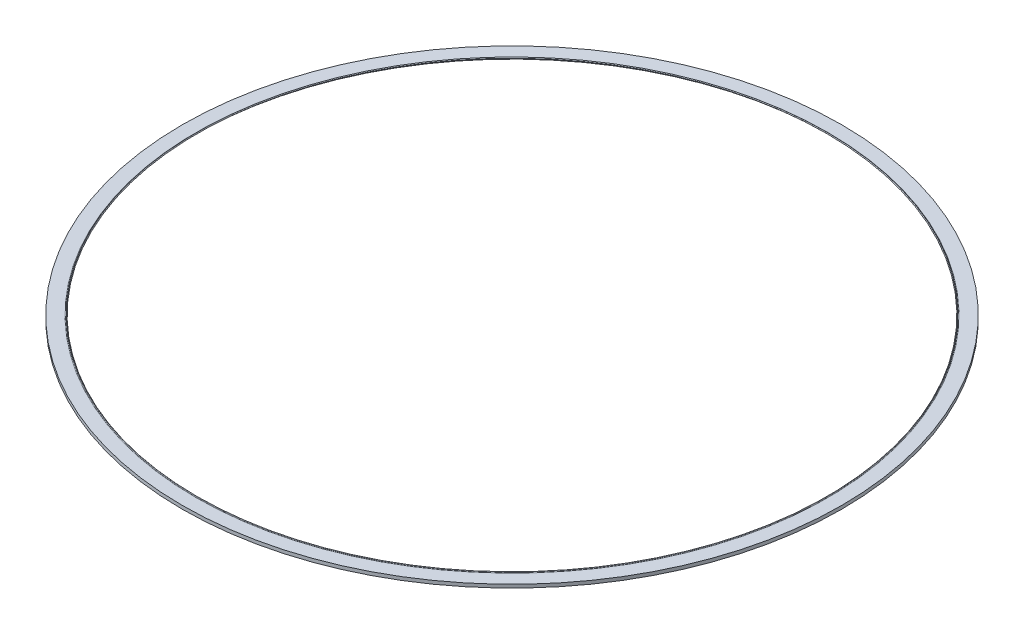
ISO-10303-21;
HEADER;
FILE_DESCRIPTION(('STEP AP214'),'2;1');
FILE_NAME('part.step','',(''),(''),'','','');
FILE_SCHEMA(('AUTOMOTIVE_DESIGN { 1 0 10303 214 1 1 1 1 }'));
ENDSEC;
DATA;
#1=APPLICATION_CONTEXT('core data for automotive mechanical design processes');
#2=APPLICATION_PROTOCOL_DEFINITION('international standard','automotive_design',2000,#1);
#3=PRODUCT_CONTEXT('',#1,'mechanical');
#4=PRODUCT('Part','Part','',(#3));
#5=PRODUCT_RELATED_PRODUCT_CATEGORY('part','',(#4));
#6=PRODUCT_DEFINITION_FORMATION('','',#4);
#7=PRODUCT_DEFINITION_CONTEXT('part definition',#1,'design');
#8=PRODUCT_DEFINITION('design','',#6,#7);
#9=PRODUCT_DEFINITION_SHAPE('','',#8);
#10=(LENGTH_UNIT() NAMED_UNIT(*) SI_UNIT(.MILLI.,.METRE.));
#11=(NAMED_UNIT(*) PLANE_ANGLE_UNIT() SI_UNIT($,.RADIAN.));
#12=(NAMED_UNIT(*) SI_UNIT($,.STERADIAN.) SOLID_ANGLE_UNIT());
#13=UNCERTAINTY_MEASURE_WITH_UNIT(LENGTH_MEASURE(1.E-05),#10,'distance_accuracy_value','');
#14=(GEOMETRIC_REPRESENTATION_CONTEXT(3) GLOBAL_UNCERTAINTY_ASSIGNED_CONTEXT((#13)) GLOBAL_UNIT_ASSIGNED_CONTEXT((#10,
#11,#12)) REPRESENTATION_CONTEXT('',''));
#15=CARTESIAN_POINT('',(0.,0.,0.));
#16=DIRECTION('',(0.,0.,1.));
#17=DIRECTION('',(1.,0.,0.));
#18=AXIS2_PLACEMENT_3D('',#15,#16,#17);
#19=CARTESIAN_POINT('',(0.,0.,0.));
#20=DIRECTION('',(0.,-1.,0.));
#21=DIRECTION('',(0.,0.,-1.));
#22=AXIS2_PLACEMENT_3D('',#19,#20,#21);
#23=CYLINDRICAL_SURFACE('',#22,62.6745);
#24=CARTESIAN_POINT('',(0.,0.,0.));
#25=DIRECTION('',(0.,-1.,0.));
#26=DIRECTION('',(0.,0.,-1.));
#27=AXIS2_PLACEMENT_3D('',#24,#25,#26);
#28=CIRCLE('',#27,62.6745);
#29=CARTESIAN_POINT('',(0.,0.,-62.6745));
#30=VERTEX_POINT('',#29);
#31=EDGE_CURVE('E10',#30,#30,#28,.T.);
#32=ORIENTED_EDGE('',*,*,#31,.F.);
#33=EDGE_LOOP('',(#32));
#34=FACE_BOUND('',#33,.T.);
#35=CARTESIAN_POINT('',(0.,0.634999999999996,0.));
#36=DIRECTION('',(0.,-1.,0.));
#37=DIRECTION('',(0.,0.,-1.));
#38=AXIS2_PLACEMENT_3D('',#35,#36,#37);
#39=CIRCLE('',#38,62.6745);
#40=CARTESIAN_POINT('',(0.,0.634999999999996,-62.6745));
#41=VERTEX_POINT('',#40);
#42=EDGE_CURVE('E63',#41,#41,#39,.T.);
#43=ORIENTED_EDGE('',*,*,#42,.T.);
#44=EDGE_LOOP('',(#43));
#45=FACE_BOUND('',#44,.T.);
#46=ADVANCED_FACE('F29',(#34,#45),#23,.T.);
#47=CARTESIAN_POINT('',(-62.6745,0.,0.));
#48=DIRECTION('',(0.,1.,0.));
#49=DIRECTION('',(0.,0.,1.));
#50=AXIS2_PLACEMENT_3D('',#47,#48,#49);
#51=PLANE('',#50);
#52=CARTESIAN_POINT('',(0.,0.,0.));
#53=DIRECTION('',(0.,-1.,0.));
#54=DIRECTION('',(0.,0.,-1.));
#55=AXIS2_PLACEMENT_3D('',#52,#53,#54);
#56=CIRCLE('',#55,60.4901);
#57=CARTESIAN_POINT('',(0.,0.,-60.4901));
#58=VERTEX_POINT('',#57);
#59=EDGE_CURVE('E35',#58,#58,#56,.T.);
#60=ORIENTED_EDGE('',*,*,#59,.F.);
#61=EDGE_LOOP('',(#60));
#62=FACE_BOUND('',#61,.T.);
#63=ORIENTED_EDGE('',*,*,#31,.T.);
#64=EDGE_LOOP('',(#63));
#65=FACE_BOUND('',#64,.T.);
#66=ADVANCED_FACE('F112',(#62,#65),#51,.F.);
#67=CARTESIAN_POINT('',(0.,0.,0.));
#68=DIRECTION('',(0.,-1.,0.));
#69=DIRECTION('',(0.,0.,-1.));
#70=AXIS2_PLACEMENT_3D('',#67,#68,#69);
#71=CYLINDRICAL_SURFACE('',#70,60.4901);
#72=CARTESIAN_POINT('',(0.,0.457199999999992,0.));
#73=DIRECTION('',(0.,-1.,0.));
#74=DIRECTION('',(0.,0.,-1.));
#75=AXIS2_PLACEMENT_3D('',#72,#73,#74);
#76=CIRCLE('',#75,60.4901);
#77=CARTESIAN_POINT('',(0.,0.457199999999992,-60.4901));
#78=VERTEX_POINT('',#77);
#79=EDGE_CURVE('E39',#78,#78,#76,.T.);
#80=ORIENTED_EDGE('',*,*,#79,.F.);
#81=EDGE_LOOP('',(#80));
#82=FACE_BOUND('',#81,.T.);
#83=ORIENTED_EDGE('',*,*,#59,.T.);
#84=EDGE_LOOP('',(#83));
#85=FACE_BOUND('',#84,.T.);
#86=ADVANCED_FACE('F107',(#82,#85),#71,.F.);
#87=CARTESIAN_POINT('',(-60.1020022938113,0.457199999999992,0.));
#88=DIRECTION('',(0.,1.,0.));
#89=DIRECTION('',(0.,0.,1.));
#90=AXIS2_PLACEMENT_3D('',#87,#88,#89);
#91=PLANE('',#90);
#92=CARTESIAN_POINT('',(0.,0.457199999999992,0.));
#93=DIRECTION('',(0.,-1.,0.));
#94=DIRECTION('',(0.,0.,-1.));
#95=AXIS2_PLACEMENT_3D('',#92,#93,#94);
#96=CIRCLE('',#95,60.1020022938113);
#97=CARTESIAN_POINT('',(0.,0.457199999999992,-60.1020022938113));
#98=VERTEX_POINT('',#97);
#99=EDGE_CURVE('E43',#98,#98,#96,.T.);
#100=ORIENTED_EDGE('',*,*,#99,.F.);
#101=EDGE_LOOP('',(#100));
#102=FACE_BOUND('',#101,.T.);
#103=ORIENTED_EDGE('',*,*,#79,.T.);
#104=EDGE_LOOP('',(#103));
#105=FACE_BOUND('',#104,.T.);
#106=ADVANCED_FACE('F101',(#102,#105),#91,.F.);
#107=CARTESIAN_POINT('',(0.,0.761999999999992,0.));
#108=DIRECTION('',(0.,-1.,0.));
#109=DIRECTION('',(0.,0.,-1.));
#110=AXIS2_PLACEMENT_3D('',#107,#108,#109);
#111=TOROIDAL_SURFACE('',#110,60.1020022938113,0.304799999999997);
#112=CARTESIAN_POINT('',(0.,0.546473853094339,0.));
#113=DIRECTION('',(0.,-1.,0.));
#114=DIRECTION('',(0.,0.,-1.));
#115=AXIS2_PLACEMENT_3D('',#112,#113,#114);
#116=CIRCLE('',#115,59.8864761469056);
#117=CARTESIAN_POINT('',(0.,0.546473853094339,-59.8864761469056));
#118=VERTEX_POINT('',#117);
#119=EDGE_CURVE('E48',#118,#118,#116,.T.);
#120=ORIENTED_EDGE('',*,*,#119,.F.);
#121=EDGE_LOOP('',(#120));
#122=FACE_BOUND('',#121,.T.);
#123=ORIENTED_EDGE('',*,*,#99,.T.);
#124=EDGE_LOOP('',(#123));
#125=FACE_BOUND('',#124,.T.);
#126=ADVANCED_FACE('F95',(#122,#125),#111,.T.);
#127=CARTESIAN_POINT('',(0.,0.546473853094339,0.));
#128=DIRECTION('',(0.,-1.,0.));
#129=DIRECTION('',(0.,0.,-1.));
#130=AXIS2_PLACEMENT_3D('',#127,#128,#129);
#131=CONICAL_SURFACE('',#130,59.8864761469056,0.785398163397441);
#132=CARTESIAN_POINT('',(0.,0.632637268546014,0.));
#133=DIRECTION('',(0.,-1.,0.));
#134=DIRECTION('',(0.,0.,-1.));
#135=AXIS2_PLACEMENT_3D('',#132,#133,#134);
#136=CIRCLE('',#135,59.800312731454);
#137=CARTESIAN_POINT('',(0.,0.632637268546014,-59.800312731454));
#138=VERTEX_POINT('',#137);
#139=EDGE_CURVE('E51',#138,#138,#136,.T.);
#140=ORIENTED_EDGE('',*,*,#139,.F.);
#141=EDGE_LOOP('',(#140));
#142=FACE_BOUND('',#141,.T.);
#143=ORIENTED_EDGE('',*,*,#119,.T.);
#144=EDGE_LOOP('',(#143));
#145=FACE_BOUND('',#144,.T.);
#146=ADVANCED_FACE('F89',(#142,#145),#131,.F.);
#147=CARTESIAN_POINT('',(0.,0.632637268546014,0.));
#148=DIRECTION('',(0.,1.,0.));
#149=DIRECTION('',(0.,0.,1.));
#150=AXIS2_PLACEMENT_3D('',#147,#148,#149);
#151=CONICAL_SURFACE('',#150,59.800312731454,0.785398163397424);
#152=CARTESIAN_POINT('',(0.,0.754873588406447,0.));
#153=DIRECTION('',(0.,-1.,0.));
#154=DIRECTION('',(0.,0.,-1.));
#155=AXIS2_PLACEMENT_3D('',#152,#153,#154);
#156=CIRCLE('',#155,59.9225490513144);
#157=CARTESIAN_POINT('',(0.,0.754873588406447,-59.9225490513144));
#158=VERTEX_POINT('',#157);
#159=EDGE_CURVE('E54',#158,#158,#156,.T.);
#160=ORIENTED_EDGE('',*,*,#159,.F.);
#161=EDGE_LOOP('',(#160));
#162=FACE_BOUND('',#161,.T.);
#163=ORIENTED_EDGE('',*,*,#139,.T.);
#164=EDGE_LOOP('',(#163));
#165=FACE_BOUND('',#164,.T.);
#166=ADVANCED_FACE('F83',(#162,#165),#151,.F.);
#167=CARTESIAN_POINT('',(0.,0.754873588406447,0.));
#168=DIRECTION('',(0.,-1.,0.));
#169=DIRECTION('',(0.,0.,-1.));
#170=AXIS2_PLACEMENT_3D('',#167,#168,#169);
#171=CONICAL_SURFACE('',#170,59.9225490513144,0.785398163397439);
#172=CARTESIAN_POINT('',(0.,0.672197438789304,0.));
#173=DIRECTION('',(0.,-1.,0.));
#174=DIRECTION('',(0.,0.,-1.));
#175=AXIS2_PLACEMENT_3D('',#172,#173,#174);
#176=CIRCLE('',#175,60.0052252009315);
#177=CARTESIAN_POINT('',(0.,0.672197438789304,-60.0052252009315));
#178=VERTEX_POINT('',#177);
#179=EDGE_CURVE('E57',#178,#178,#176,.T.);
#180=ORIENTED_EDGE('',*,*,#179,.F.);
#181=EDGE_LOOP('',(#180));
#182=FACE_BOUND('',#181,.T.);
#183=ORIENTED_EDGE('',*,*,#159,.T.);
#184=EDGE_LOOP('',(#183));
#185=FACE_BOUND('',#184,.T.);
#186=ADVANCED_FACE('F77',(#182,#185),#171,.T.);
#187=CARTESIAN_POINT('',(0.,0.761999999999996,0.));
#188=DIRECTION('',(0.,-1.,0.));
#189=DIRECTION('',(0.,0.,-1.));
#190=AXIS2_PLACEMENT_3D('',#187,#188,#189);
#191=TOROIDAL_SURFACE('',#190,60.0950277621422,0.126999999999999);
#192=CARTESIAN_POINT('',(0.,0.634999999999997,0.));
#193=DIRECTION('',(0.,-1.,0.));
#194=DIRECTION('',(0.,0.,-1.));
#195=AXIS2_PLACEMENT_3D('',#192,#193,#194);
#196=CIRCLE('',#195,60.0950277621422);
#197=CARTESIAN_POINT('',(0.,0.634999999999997,-60.0950277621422));
#198=VERTEX_POINT('',#197);
#199=EDGE_CURVE('E60',#198,#198,#196,.T.);
#200=ORIENTED_EDGE('',*,*,#199,.F.);
#201=EDGE_LOOP('',(#200));
#202=FACE_BOUND('',#201,.T.);
#203=ORIENTED_EDGE('',*,*,#179,.T.);
#204=EDGE_LOOP('',(#203));
#205=FACE_BOUND('',#204,.T.);
#206=ADVANCED_FACE('F71',(#202,#205),#191,.F.);
#207=CARTESIAN_POINT('',(-62.6745,0.634999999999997,0.));
#208=DIRECTION('',(0.,-1.,0.));
#209=DIRECTION('',(0.,0.,-1.));
#210=AXIS2_PLACEMENT_3D('',#207,#208,#209);
#211=PLANE('',#210);
#212=ORIENTED_EDGE('',*,*,#42,.F.);
#213=EDGE_LOOP('',(#212));
#214=FACE_BOUND('',#213,.T.);
#215=ORIENTED_EDGE('',*,*,#199,.T.);
#216=EDGE_LOOP('',(#215));
#217=FACE_BOUND('',#216,.T.);
#218=ADVANCED_FACE('F68',(#214,#217),#211,.F.);
#219=CLOSED_SHELL('',(#46,#66,#86,#106,#126,#146,#166,#186,#206,#218));
#220=MANIFOLD_SOLID_BREP('B2',#219);
#221=ADVANCED_BREP_SHAPE_REPRESENTATION('',(#18,#220),#14);
#222=SHAPE_DEFINITION_REPRESENTATION(#9,#221);
ENDSEC;
END-ISO-10303-21;
